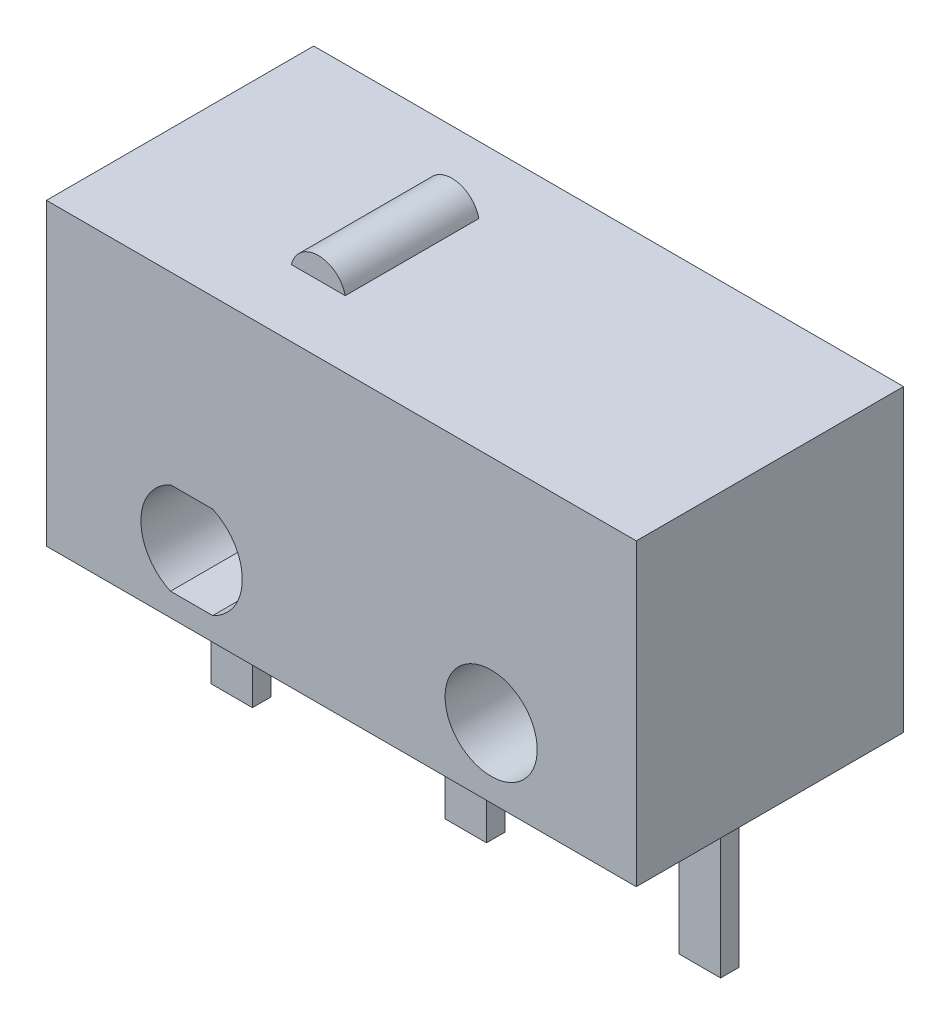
ISO-10303-21;
HEADER;
FILE_DESCRIPTION(('STEP AP214'),'2;1');
FILE_NAME('part.step','',(''),(''),'','','');
FILE_SCHEMA(('AUTOMOTIVE_DESIGN { 1 0 10303 214 1 1 1 1 }'));
ENDSEC;
DATA;
#1=APPLICATION_CONTEXT('core data for automotive mechanical design processes');
#2=APPLICATION_PROTOCOL_DEFINITION('international standard','automotive_design',2000,#1);
#3=PRODUCT_CONTEXT('',#1,'mechanical');
#4=PRODUCT('Part','Part','',(#3));
#5=PRODUCT_RELATED_PRODUCT_CATEGORY('part','',(#4));
#6=PRODUCT_DEFINITION_FORMATION('','',#4);
#7=PRODUCT_DEFINITION_CONTEXT('part definition',#1,'design');
#8=PRODUCT_DEFINITION('design','',#6,#7);
#9=PRODUCT_DEFINITION_SHAPE('','',#8);
#10=(LENGTH_UNIT() NAMED_UNIT(*) SI_UNIT(.MILLI.,.METRE.));
#11=(NAMED_UNIT(*) PLANE_ANGLE_UNIT() SI_UNIT($,.RADIAN.));
#12=(NAMED_UNIT(*) SI_UNIT($,.STERADIAN.) SOLID_ANGLE_UNIT());
#13=UNCERTAINTY_MEASURE_WITH_UNIT(LENGTH_MEASURE(1.E-05),#10,'distance_accuracy_value','');
#14=(GEOMETRIC_REPRESENTATION_CONTEXT(3) GLOBAL_UNCERTAINTY_ASSIGNED_CONTEXT((#13)) GLOBAL_UNIT_ASSIGNED_CONTEXT((#10,
#11,#12)) REPRESENTATION_CONTEXT('',''));
#15=CARTESIAN_POINT('',(0.,0.,0.));
#16=DIRECTION('',(0.,0.,1.));
#17=DIRECTION('',(1.,0.,0.));
#18=AXIS2_PLACEMENT_3D('',#15,#16,#17);
#19=CARTESIAN_POINT('',(-9.65,5.,-2.9));
#20=DIRECTION('',(0.,1.,0.));
#21=DIRECTION('',(0.,0.,1.));
#22=AXIS2_PLACEMENT_3D('',#19,#20,#21);
#23=PLANE('',#22);
#24=DIRECTION('',(0.,0.,1.));
#25=VECTOR('',#24,1.);
#26=CARTESIAN_POINT('',(3.15,5.,-2.9));
#27=LINE('',#26,#25);
#28=CARTESIAN_POINT('',(3.15,5.,-2.9));
#29=VERTEX_POINT('',#28);
#30=CARTESIAN_POINT('',(3.15,5.,2.9));
#31=VERTEX_POINT('',#30);
#32=EDGE_CURVE('E328',#29,#31,#27,.T.);
#33=ORIENTED_EDGE('',*,*,#32,.F.);
#34=DIRECTION('',(1.,0.,0.));
#35=VECTOR('',#34,1.);
#36=CARTESIAN_POINT('',(-9.65,5.,-2.9));
#37=LINE('',#36,#35);
#38=CARTESIAN_POINT('',(-9.65,5.,-2.9));
#39=VERTEX_POINT('',#38);
#40=EDGE_CURVE('E346',#39,#29,#37,.T.);
#41=ORIENTED_EDGE('',*,*,#40,.F.);
#42=DIRECTION('',(0.,0.,1.));
#43=VECTOR('',#42,1.);
#44=CARTESIAN_POINT('',(-9.65,5.,-2.9));
#45=LINE('',#44,#43);
#46=CARTESIAN_POINT('',(-9.65,5.,2.9));
#47=VERTEX_POINT('',#46);
#48=EDGE_CURVE('E340',#39,#47,#45,.T.);
#49=ORIENTED_EDGE('',*,*,#48,.T.);
#50=DIRECTION('',(1.,0.,0.));
#51=VECTOR('',#50,1.);
#52=CARTESIAN_POINT('',(-9.65,5.,2.9));
#53=LINE('',#52,#51);
#54=EDGE_CURVE('E41',#47,#31,#53,.T.);
#55=ORIENTED_EDGE('',*,*,#54,.T.);
#56=EDGE_LOOP('',(#33,#41,#49,#55));
#57=FACE_BOUND('',#56,.T.);
#58=DIRECTION('',(0.,0.,-1.));
#59=VECTOR('',#58,1.);
#60=CARTESIAN_POINT('',(-4.61560692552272,5.,1.45));
#61=LINE('',#60,#59);
#62=CARTESIAN_POINT('',(-4.61560692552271,5.,1.45));
#63=VERTEX_POINT('',#62);
#64=CARTESIAN_POINT('',(-4.61560692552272,5.,-1.45));
#65=VERTEX_POINT('',#64);
#66=EDGE_CURVE('E49',#63,#65,#61,.T.);
#67=ORIENTED_EDGE('',*,*,#66,.F.);
#68=DIRECTION('',(-1.,0.,0.));
#69=VECTOR('',#68,1.);
#70=CARTESIAN_POINT('',(-4.61560692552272,5.,1.45));
#71=LINE('',#70,#69);
#72=CARTESIAN_POINT('',(-5.78439307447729,5.,1.45));
#73=VERTEX_POINT('',#72);
#74=EDGE_CURVE('E54',#63,#73,#71,.T.);
#75=ORIENTED_EDGE('',*,*,#74,.T.);
#76=DIRECTION('',(0.,0.,-1.));
#77=VECTOR('',#76,1.);
#78=CARTESIAN_POINT('',(-5.78439307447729,5.,1.45));
#79=LINE('',#78,#77);
#80=CARTESIAN_POINT('',(-5.78439307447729,5.,-1.45));
#81=VERTEX_POINT('',#80);
#82=EDGE_CURVE('E178',#73,#81,#79,.T.);
#83=ORIENTED_EDGE('',*,*,#82,.T.);
#84=DIRECTION('',(-1.,0.,0.));
#85=VECTOR('',#84,1.);
#86=CARTESIAN_POINT('',(-4.61560692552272,5.,-1.45));
#87=LINE('',#86,#85);
#88=EDGE_CURVE('E181',#65,#81,#87,.T.);
#89=ORIENTED_EDGE('',*,*,#88,.F.);
#90=EDGE_LOOP('',(#67,#75,#83,#89));
#91=FACE_BOUND('',#90,.T.);
#92=ADVANCED_FACE('F32',(#57,#91),#23,.T.);
#93=CARTESIAN_POINT('',(-9.65,-1.5,2.9));
#94=DIRECTION('',(0.,-1.,0.));
#95=DIRECTION('',(0.,0.,-1.));
#96=AXIS2_PLACEMENT_3D('',#93,#94,#95);
#97=PLANE('',#96);
#98=DIRECTION('',(0.,0.,1.));
#99=VECTOR('',#98,1.);
#100=CARTESIAN_POINT('',(-2.8,-1.5,0.2));
#101=LINE('',#100,#99);
#102=CARTESIAN_POINT('',(-2.8,-1.5,-0.2));
#103=VERTEX_POINT('',#102);
#104=CARTESIAN_POINT('',(-2.8,-1.5,0.2));
#105=VERTEX_POINT('',#104);
#106=EDGE_CURVE('E229',#103,#105,#101,.T.);
#107=ORIENTED_EDGE('',*,*,#106,.F.);
#108=DIRECTION('',(1.,0.,0.));
#109=VECTOR('',#108,1.);
#110=CARTESIAN_POINT('',(-2.8,-1.5,-0.2));
#111=LINE('',#110,#109);
#112=CARTESIAN_POINT('',(-3.7,-1.5,-0.2));
#113=VERTEX_POINT('',#112);
#114=EDGE_CURVE('E226',#113,#103,#111,.T.);
#115=ORIENTED_EDGE('',*,*,#114,.F.);
#116=DIRECTION('',(0.,0.,-1.));
#117=VECTOR('',#116,1.);
#118=CARTESIAN_POINT('',(-3.7,-1.5,-0.2));
#119=LINE('',#118,#117);
#120=CARTESIAN_POINT('',(-3.7,-1.5,0.2));
#121=VERTEX_POINT('',#120);
#122=EDGE_CURVE('E234',#121,#113,#119,.T.);
#123=ORIENTED_EDGE('',*,*,#122,.F.);
#124=DIRECTION('',(-1.,0.,0.));
#125=VECTOR('',#124,1.);
#126=CARTESIAN_POINT('',(-3.7,-1.5,0.2));
#127=LINE('',#126,#125);
#128=EDGE_CURVE('E231',#105,#121,#127,.T.);
#129=ORIENTED_EDGE('',*,*,#128,.F.);
#130=EDGE_LOOP('',(#107,#115,#123,#129));
#131=FACE_BOUND('',#130,.T.);
#132=DIRECTION('',(0.,0.,-1.));
#133=VECTOR('',#132,1.);
#134=CARTESIAN_POINT('',(3.15,-1.5,2.9));
#135=LINE('',#134,#133);
#136=CARTESIAN_POINT('',(3.15,-1.5,2.9));
#137=VERTEX_POINT('',#136);
#138=CARTESIAN_POINT('',(3.15,-1.5,-2.9));
#139=VERTEX_POINT('',#138);
#140=EDGE_CURVE('E316',#137,#139,#135,.T.);
#141=ORIENTED_EDGE('',*,*,#140,.F.);
#142=DIRECTION('',(1.,0.,0.));
#143=VECTOR('',#142,1.);
#144=CARTESIAN_POINT('',(-9.65,-1.5,2.9));
#145=LINE('',#144,#143);
#146=CARTESIAN_POINT('',(-9.65,-1.5,2.9));
#147=VERTEX_POINT('',#146);
#148=EDGE_CURVE('E11',#147,#137,#145,.T.);
#149=ORIENTED_EDGE('',*,*,#148,.F.);
#150=DIRECTION('',(0.,0.,-1.));
#151=VECTOR('',#150,1.);
#152=CARTESIAN_POINT('',(-9.65,-1.5,2.9));
#153=LINE('',#152,#151);
#154=CARTESIAN_POINT('',(-9.65,-1.5,-2.9));
#155=VERTEX_POINT('',#154);
#156=EDGE_CURVE('E334',#147,#155,#153,.T.);
#157=ORIENTED_EDGE('',*,*,#156,.T.);
#158=DIRECTION('',(1.,0.,0.));
#159=VECTOR('',#158,1.);
#160=CARTESIAN_POINT('',(-9.65,-1.5,-2.9));
#161=LINE('',#160,#159);
#162=EDGE_CURVE('E36',#155,#139,#161,.T.);
#163=ORIENTED_EDGE('',*,*,#162,.T.);
#164=EDGE_LOOP('',(#141,#149,#157,#163));
#165=FACE_BOUND('',#164,.T.);
#166=DIRECTION('',(0.,0.,-1.));
#167=VECTOR('',#166,1.);
#168=CARTESIAN_POINT('',(-8.78,-1.5,-0.2));
#169=LINE('',#168,#167);
#170=CARTESIAN_POINT('',(-8.78,-1.5,0.2));
#171=VERTEX_POINT('',#170);
#172=CARTESIAN_POINT('',(-8.78,-1.5,-0.2));
#173=VERTEX_POINT('',#172);
#174=EDGE_CURVE('E258',#171,#173,#169,.T.);
#175=ORIENTED_EDGE('',*,*,#174,.F.);
#176=DIRECTION('',(-1.,0.,0.));
#177=VECTOR('',#176,1.);
#178=CARTESIAN_POINT('',(-8.78,-1.5,0.2));
#179=LINE('',#178,#177);
#180=CARTESIAN_POINT('',(-7.88,-1.5,0.2));
#181=VERTEX_POINT('',#180);
#182=EDGE_CURVE('E255',#181,#171,#179,.T.);
#183=ORIENTED_EDGE('',*,*,#182,.F.);
#184=DIRECTION('',(0.,0.,1.));
#185=VECTOR('',#184,1.);
#186=CARTESIAN_POINT('',(-7.88,-1.5,0.2));
#187=LINE('',#186,#185);
#188=CARTESIAN_POINT('',(-7.88,-1.5,-0.2));
#189=VERTEX_POINT('',#188);
#190=EDGE_CURVE('E263',#189,#181,#187,.T.);
#191=ORIENTED_EDGE('',*,*,#190,.F.);
#192=DIRECTION('',(1.,0.,0.));
#193=VECTOR('',#192,1.);
#194=CARTESIAN_POINT('',(-7.88,-1.5,-0.2));
#195=LINE('',#194,#193);
#196=EDGE_CURVE('E260',#173,#189,#195,.T.);
#197=ORIENTED_EDGE('',*,*,#196,.F.);
#198=EDGE_LOOP('',(#175,#183,#191,#197));
#199=FACE_BOUND('',#198,.T.);
#200=DIRECTION('',(0.,0.,1.));
#201=VECTOR('',#200,1.);
#202=CARTESIAN_POINT('',(2.28,-1.5,0.2));
#203=LINE('',#202,#201);
#204=CARTESIAN_POINT('',(2.28,-1.5,-0.2));
#205=VERTEX_POINT('',#204);
#206=CARTESIAN_POINT('',(2.28,-1.5,0.2));
#207=VERTEX_POINT('',#206);
#208=EDGE_CURVE('E200',#205,#207,#203,.T.);
#209=ORIENTED_EDGE('',*,*,#208,.F.);
#210=DIRECTION('',(1.,0.,0.));
#211=VECTOR('',#210,1.);
#212=CARTESIAN_POINT('',(2.28,-1.5,-0.2));
#213=LINE('',#212,#211);
#214=CARTESIAN_POINT('',(1.38,-1.5,-0.2));
#215=VERTEX_POINT('',#214);
#216=EDGE_CURVE('E184',#215,#205,#213,.T.);
#217=ORIENTED_EDGE('',*,*,#216,.F.);
#218=DIRECTION('',(0.,0.,-1.));
#219=VECTOR('',#218,1.);
#220=CARTESIAN_POINT('',(1.38,-1.5,-0.2));
#221=LINE('',#220,#219);
#222=CARTESIAN_POINT('',(1.38,-1.5,0.2));
#223=VERTEX_POINT('',#222);
#224=EDGE_CURVE('E205',#223,#215,#221,.T.);
#225=ORIENTED_EDGE('',*,*,#224,.F.);
#226=DIRECTION('',(-1.,0.,0.));
#227=VECTOR('',#226,1.);
#228=CARTESIAN_POINT('',(1.38,-1.5,0.2));
#229=LINE('',#228,#227);
#230=EDGE_CURVE('E202',#207,#223,#229,.T.);
#231=ORIENTED_EDGE('',*,*,#230,.F.);
#232=EDGE_LOOP('',(#209,#217,#225,#231));
#233=FACE_BOUND('',#232,.T.);
#234=ADVANCED_FACE('F34',(#131,#165,#199,#233),#97,.T.);
#235=CARTESIAN_POINT('',(-9.65,5.,2.9));
#236=DIRECTION('',(0.,0.,1.));
#237=DIRECTION('',(1.,0.,0.));
#238=AXIS2_PLACEMENT_3D('',#235,#236,#237);
#239=PLANE('',#238);
#240=CARTESIAN_POINT('',(0.,0.,2.9));
#241=DIRECTION('',(0.,0.,1.));
#242=DIRECTION('',(-1.,0.,0.));
#243=AXIS2_PLACEMENT_3D('',#240,#241,#242);
#244=CIRCLE('',#243,1.);
#245=CARTESIAN_POINT('',(-1.,0.,2.9));
#246=VERTEX_POINT('',#245);
#247=EDGE_CURVE('E284',#246,#246,#244,.T.);
#248=ORIENTED_EDGE('',*,*,#247,.F.);
#249=EDGE_LOOP('',(#248));
#250=FACE_BOUND('',#249,.T.);
#251=CARTESIAN_POINT('',(-6.5,0.,2.9));
#252=DIRECTION('',(0.,0.,1.));
#253=DIRECTION('',(1.,0.,0.));
#254=AXIS2_PLACEMENT_3D('',#251,#252,#253);
#255=CIRCLE('',#254,1.1);
#256=CARTESIAN_POINT('',(-6.95825756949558,1.,2.9));
#257=VERTEX_POINT('',#256);
#258=CARTESIAN_POINT('',(-6.95825756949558,-1.,2.9));
#259=VERTEX_POINT('',#258);
#260=EDGE_CURVE('E290',#257,#259,#255,.T.);
#261=ORIENTED_EDGE('',*,*,#260,.F.);
#262=DIRECTION('',(-1.,0.,0.));
#263=VECTOR('',#262,1.);
#264=CARTESIAN_POINT('',(-6.04174243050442,1.,2.9));
#265=LINE('',#264,#263);
#266=CARTESIAN_POINT('',(-6.04174243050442,1.,2.9));
#267=VERTEX_POINT('',#266);
#268=EDGE_CURVE('E298',#267,#257,#265,.T.);
#269=ORIENTED_EDGE('',*,*,#268,.F.);
#270=CARTESIAN_POINT('',(-6.5,0.,2.9));
#271=DIRECTION('',(0.,0.,1.));
#272=DIRECTION('',(1.,0.,0.));
#273=AXIS2_PLACEMENT_3D('',#270,#271,#272);
#274=CIRCLE('',#273,1.1);
#275=CARTESIAN_POINT('',(-6.04174243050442,-1.,2.9));
#276=VERTEX_POINT('',#275);
#277=EDGE_CURVE('E295',#276,#267,#274,.T.);
#278=ORIENTED_EDGE('',*,*,#277,.F.);
#279=DIRECTION('',(1.,0.,0.));
#280=VECTOR('',#279,1.);
#281=CARTESIAN_POINT('',(-6.95825756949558,-1.,2.9));
#282=LINE('',#281,#280);
#283=EDGE_CURVE('E292',#259,#276,#282,.T.);
#284=ORIENTED_EDGE('',*,*,#283,.F.);
#285=EDGE_LOOP('',(#261,#269,#278,#284));
#286=FACE_BOUND('',#285,.T.);
#287=DIRECTION('',(0.,-1.,0.));
#288=VECTOR('',#287,1.);
#289=CARTESIAN_POINT('',(3.15,5.,2.9));
#290=LINE('',#289,#288);
#291=EDGE_CURVE('E331',#31,#137,#290,.T.);
#292=ORIENTED_EDGE('',*,*,#291,.F.);
#293=ORIENTED_EDGE('',*,*,#54,.F.);
#294=DIRECTION('',(0.,-1.,0.));
#295=VECTOR('',#294,1.);
#296=CARTESIAN_POINT('',(-9.65,5.,2.9));
#297=LINE('',#296,#295);
#298=EDGE_CURVE('E343',#47,#147,#297,.T.);
#299=ORIENTED_EDGE('',*,*,#298,.T.);
#300=ORIENTED_EDGE('',*,*,#148,.T.);
#301=EDGE_LOOP('',(#292,#293,#299,#300));
#302=FACE_BOUND('',#301,.T.);
#303=ADVANCED_FACE('F360',(#250,#286,#302),#239,.T.);
#304=CARTESIAN_POINT('',(-9.65,-1.5,-2.9));
#305=DIRECTION('',(0.,0.,-1.));
#306=DIRECTION('',(-1.,0.,0.));
#307=AXIS2_PLACEMENT_3D('',#304,#305,#306);
#308=PLANE('',#307);
#309=CARTESIAN_POINT('',(0.,0.,-2.9));
#310=DIRECTION('',(0.,0.,1.));
#311=DIRECTION('',(-1.,0.,0.));
#312=AXIS2_PLACEMENT_3D('',#309,#310,#311);
#313=CIRCLE('',#312,1.);
#314=CARTESIAN_POINT('',(-1.,0.,-2.9));
#315=VERTEX_POINT('',#314);
#316=EDGE_CURVE('E287',#315,#315,#313,.T.);
#317=ORIENTED_EDGE('',*,*,#316,.T.);
#318=EDGE_LOOP('',(#317));
#319=FACE_BOUND('',#318,.T.);
#320=CARTESIAN_POINT('',(-6.5,0.,-2.9));
#321=DIRECTION('',(0.,0.,1.));
#322=DIRECTION('',(1.,0.,0.));
#323=AXIS2_PLACEMENT_3D('',#320,#321,#322);
#324=CIRCLE('',#323,1.1);
#325=CARTESIAN_POINT('',(-6.95825756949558,1.,-2.9));
#326=VERTEX_POINT('',#325);
#327=CARTESIAN_POINT('',(-6.95825756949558,-1.,-2.9));
#328=VERTEX_POINT('',#327);
#329=EDGE_CURVE('E301',#326,#328,#324,.T.);
#330=ORIENTED_EDGE('',*,*,#329,.T.);
#331=DIRECTION('',(1.,0.,0.));
#332=VECTOR('',#331,1.);
#333=CARTESIAN_POINT('',(-6.95825756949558,-1.,-2.9));
#334=LINE('',#333,#332);
#335=CARTESIAN_POINT('',(-6.04174243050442,-1.,-2.9));
#336=VERTEX_POINT('',#335);
#337=EDGE_CURVE('E304',#328,#336,#334,.T.);
#338=ORIENTED_EDGE('',*,*,#337,.T.);
#339=CARTESIAN_POINT('',(-6.5,0.,-2.9));
#340=DIRECTION('',(0.,0.,1.));
#341=DIRECTION('',(1.,0.,0.));
#342=AXIS2_PLACEMENT_3D('',#339,#340,#341);
#343=CIRCLE('',#342,1.1);
#344=CARTESIAN_POINT('',(-6.04174243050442,1.,-2.9));
#345=VERTEX_POINT('',#344);
#346=EDGE_CURVE('E307',#336,#345,#343,.T.);
#347=ORIENTED_EDGE('',*,*,#346,.T.);
#348=DIRECTION('',(-1.,0.,0.));
#349=VECTOR('',#348,1.);
#350=CARTESIAN_POINT('',(-6.04174243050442,1.,-2.9));
#351=LINE('',#350,#349);
#352=EDGE_CURVE('E310',#345,#326,#351,.T.);
#353=ORIENTED_EDGE('',*,*,#352,.T.);
#354=EDGE_LOOP('',(#330,#338,#347,#353));
#355=FACE_BOUND('',#354,.T.);
#356=DIRECTION('',(0.,1.,0.));
#357=VECTOR('',#356,1.);
#358=CARTESIAN_POINT('',(3.15,-1.5,-2.9));
#359=LINE('',#358,#357);
#360=EDGE_CURVE('E325',#139,#29,#359,.T.);
#361=ORIENTED_EDGE('',*,*,#360,.F.);
#362=ORIENTED_EDGE('',*,*,#162,.F.);
#363=DIRECTION('',(0.,1.,0.));
#364=VECTOR('',#363,1.);
#365=CARTESIAN_POINT('',(-9.65,-1.5,-2.9));
#366=LINE('',#365,#364);
#367=EDGE_CURVE('E337',#155,#39,#366,.T.);
#368=ORIENTED_EDGE('',*,*,#367,.T.);
#369=ORIENTED_EDGE('',*,*,#40,.T.);
#370=EDGE_LOOP('',(#361,#362,#368,#369));
#371=FACE_BOUND('',#370,.T.);
#372=ADVANCED_FACE('F355',(#319,#355,#371),#308,.T.);
#373=CARTESIAN_POINT('',(-9.65,-1.5,-2.9));
#374=DIRECTION('',(1.,0.,0.));
#375=DIRECTION('',(0.,0.,-1.));
#376=AXIS2_PLACEMENT_3D('',#373,#374,#375);
#377=PLANE('',#376);
#378=ORIENTED_EDGE('',*,*,#156,.F.);
#379=ORIENTED_EDGE('',*,*,#298,.F.);
#380=ORIENTED_EDGE('',*,*,#48,.F.);
#381=ORIENTED_EDGE('',*,*,#367,.F.);
#382=EDGE_LOOP('',(#378,#379,#380,#381));
#383=FACE_BOUND('',#382,.T.);
#384=ADVANCED_FACE('F363',(#383),#377,.F.);
#385=CARTESIAN_POINT('',(3.15,-1.5,-2.9));
#386=DIRECTION('',(1.,0.,0.));
#387=DIRECTION('',(0.,0.,-1.));
#388=AXIS2_PLACEMENT_3D('',#385,#386,#387);
#389=PLANE('',#388);
#390=ORIENTED_EDGE('',*,*,#140,.T.);
#391=ORIENTED_EDGE('',*,*,#360,.T.);
#392=ORIENTED_EDGE('',*,*,#32,.T.);
#393=ORIENTED_EDGE('',*,*,#291,.T.);
#394=EDGE_LOOP('',(#390,#391,#392,#393));
#395=FACE_BOUND('',#394,.T.);
#396=ADVANCED_FACE('F357',(#395),#389,.T.);
#397=CARTESIAN_POINT('',(-6.5,0.,-2.9));
#398=DIRECTION('',(0.,0.,1.));
#399=DIRECTION('',(1.,0.,0.));
#400=AXIS2_PLACEMENT_3D('',#397,#398,#399);
#401=CYLINDRICAL_SURFACE('',#400,1.1);
#402=ORIENTED_EDGE('',*,*,#260,.T.);
#403=DIRECTION('',(0.,0.,1.));
#404=VECTOR('',#403,1.);
#405=CARTESIAN_POINT('',(-6.95825756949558,-1.,-2.9));
#406=LINE('',#405,#404);
#407=EDGE_CURVE('E313',#328,#259,#406,.T.);
#408=ORIENTED_EDGE('',*,*,#407,.F.);
#409=ORIENTED_EDGE('',*,*,#329,.F.);
#410=DIRECTION('',(0.,0.,1.));
#411=VECTOR('',#410,1.);
#412=CARTESIAN_POINT('',(-6.95825756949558,1.,-2.9));
#413=LINE('',#412,#411);
#414=EDGE_CURVE('E314',#326,#257,#413,.T.);
#415=ORIENTED_EDGE('',*,*,#414,.T.);
#416=EDGE_LOOP('',(#402,#408,#409,#415));
#417=FACE_BOUND('',#416,.T.);
#418=ADVANCED_FACE('F387',(#417),#401,.F.);
#419=CARTESIAN_POINT('',(-6.04174243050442,1.,-2.9));
#420=DIRECTION('',(0.,1.,0.));
#421=DIRECTION('',(0.,0.,1.));
#422=AXIS2_PLACEMENT_3D('',#419,#420,#421);
#423=PLANE('',#422);
#424=ORIENTED_EDGE('',*,*,#268,.T.);
#425=ORIENTED_EDGE('',*,*,#414,.F.);
#426=ORIENTED_EDGE('',*,*,#352,.F.);
#427=DIRECTION('',(0.,0.,1.));
#428=VECTOR('',#427,1.);
#429=CARTESIAN_POINT('',(-6.04174243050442,1.,-2.9));
#430=LINE('',#429,#428);
#431=EDGE_CURVE('E317',#345,#267,#430,.T.);
#432=ORIENTED_EDGE('',*,*,#431,.T.);
#433=EDGE_LOOP('',(#424,#425,#426,#432));
#434=FACE_BOUND('',#433,.T.);
#435=ADVANCED_FACE('F398',(#434),#423,.F.);
#436=CARTESIAN_POINT('',(-6.5,0.,-2.9));
#437=DIRECTION('',(0.,0.,1.));
#438=DIRECTION('',(1.,0.,0.));
#439=AXIS2_PLACEMENT_3D('',#436,#437,#438);
#440=CYLINDRICAL_SURFACE('',#439,1.1);
#441=ORIENTED_EDGE('',*,*,#277,.T.);
#442=ORIENTED_EDGE('',*,*,#431,.F.);
#443=ORIENTED_EDGE('',*,*,#346,.F.);
#444=DIRECTION('',(0.,0.,1.));
#445=VECTOR('',#444,1.);
#446=CARTESIAN_POINT('',(-6.04174243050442,-1.,-2.9));
#447=LINE('',#446,#445);
#448=EDGE_CURVE('E319',#336,#276,#447,.T.);
#449=ORIENTED_EDGE('',*,*,#448,.T.);
#450=EDGE_LOOP('',(#441,#442,#443,#449));
#451=FACE_BOUND('',#450,.T.);
#452=ADVANCED_FACE('F395',(#451),#440,.F.);
#453=CARTESIAN_POINT('',(-6.95825756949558,-1.,-2.9));
#454=DIRECTION('',(0.,-1.,0.));
#455=DIRECTION('',(0.,0.,-1.));
#456=AXIS2_PLACEMENT_3D('',#453,#454,#455);
#457=PLANE('',#456);
#458=ORIENTED_EDGE('',*,*,#283,.T.);
#459=ORIENTED_EDGE('',*,*,#448,.F.);
#460=ORIENTED_EDGE('',*,*,#337,.F.);
#461=ORIENTED_EDGE('',*,*,#407,.T.);
#462=EDGE_LOOP('',(#458,#459,#460,#461));
#463=FACE_BOUND('',#462,.T.);
#464=ADVANCED_FACE('F392',(#463),#457,.F.);
#465=CARTESIAN_POINT('',(0.,0.,-2.9));
#466=DIRECTION('',(0.,0.,1.));
#467=DIRECTION('',(1.,0.,0.));
#468=AXIS2_PLACEMENT_3D('',#465,#466,#467);
#469=CYLINDRICAL_SURFACE('',#468,1.);
#470=ORIENTED_EDGE('',*,*,#316,.F.);
#471=EDGE_LOOP('',(#470));
#472=FACE_BOUND('',#471,.T.);
#473=ORIENTED_EDGE('',*,*,#247,.T.);
#474=EDGE_LOOP('',(#473));
#475=FACE_BOUND('',#474,.T.);
#476=ADVANCED_FACE('F409',(#472,#475),#469,.F.);
#477=CARTESIAN_POINT('',(-8.78,-5.,0.2));
#478=DIRECTION('',(0.,0.,-1.));
#479=DIRECTION('',(-1.,0.,0.));
#480=AXIS2_PLACEMENT_3D('',#477,#478,#479);
#481=PLANE('',#480);
#482=ORIENTED_EDGE('',*,*,#182,.T.);
#483=DIRECTION('',(0.,1.,0.));
#484=VECTOR('',#483,1.);
#485=CARTESIAN_POINT('',(-8.78,-5.,0.2));
#486=LINE('',#485,#484);
#487=CARTESIAN_POINT('',(-8.78,-5.,0.2));
#488=VERTEX_POINT('',#487);
#489=EDGE_CURVE('E282',#488,#171,#486,.T.);
#490=ORIENTED_EDGE('',*,*,#489,.F.);
#491=DIRECTION('',(-1.,0.,0.));
#492=VECTOR('',#491,1.);
#493=CARTESIAN_POINT('',(-8.78,-5.,0.2));
#494=LINE('',#493,#492);
#495=CARTESIAN_POINT('',(-7.88,-5.,0.2));
#496=VERTEX_POINT('',#495);
#497=EDGE_CURVE('E265',#496,#488,#494,.T.);
#498=ORIENTED_EDGE('',*,*,#497,.F.);
#499=DIRECTION('',(0.,1.,0.));
#500=VECTOR('',#499,1.);
#501=CARTESIAN_POINT('',(-7.88,-5.,0.2));
#502=LINE('',#501,#500);
#503=EDGE_CURVE('E274',#496,#181,#502,.T.);
#504=ORIENTED_EDGE('',*,*,#503,.T.);
#505=EDGE_LOOP('',(#482,#490,#498,#504));
#506=FACE_BOUND('',#505,.T.);
#507=ADVANCED_FACE('F459',(#506),#481,.F.);
#508=CARTESIAN_POINT('',(-8.78,-5.,-0.2));
#509=DIRECTION('',(1.,0.,0.));
#510=DIRECTION('',(0.,0.,-1.));
#511=AXIS2_PLACEMENT_3D('',#508,#509,#510);
#512=PLANE('',#511);
#513=ORIENTED_EDGE('',*,*,#174,.T.);
#514=DIRECTION('',(0.,1.,0.));
#515=VECTOR('',#514,1.);
#516=CARTESIAN_POINT('',(-8.78,-5.,-0.2));
#517=LINE('',#516,#515);
#518=CARTESIAN_POINT('',(-8.78,-5.,-0.2));
#519=VERTEX_POINT('',#518);
#520=EDGE_CURVE('E279',#519,#173,#517,.T.);
#521=ORIENTED_EDGE('',*,*,#520,.F.);
#522=DIRECTION('',(0.,0.,-1.));
#523=VECTOR('',#522,1.);
#524=CARTESIAN_POINT('',(-8.78,-5.,-0.2));
#525=LINE('',#524,#523);
#526=EDGE_CURVE('E268',#488,#519,#525,.T.);
#527=ORIENTED_EDGE('',*,*,#526,.F.);
#528=ORIENTED_EDGE('',*,*,#489,.T.);
#529=EDGE_LOOP('',(#513,#521,#527,#528));
#530=FACE_BOUND('',#529,.T.);
#531=ADVANCED_FACE('F468',(#530),#512,.F.);
#532=CARTESIAN_POINT('',(-7.88,-5.,-0.2));
#533=DIRECTION('',(0.,0.,1.));
#534=DIRECTION('',(1.,0.,0.));
#535=AXIS2_PLACEMENT_3D('',#532,#533,#534);
#536=PLANE('',#535);
#537=ORIENTED_EDGE('',*,*,#196,.T.);
#538=DIRECTION('',(0.,1.,0.));
#539=VECTOR('',#538,1.);
#540=CARTESIAN_POINT('',(-7.88,-5.,-0.2));
#541=LINE('',#540,#539);
#542=CARTESIAN_POINT('',(-7.88,-5.,-0.2));
#543=VERTEX_POINT('',#542);
#544=EDGE_CURVE('E277',#543,#189,#541,.T.);
#545=ORIENTED_EDGE('',*,*,#544,.F.);
#546=DIRECTION('',(1.,0.,0.));
#547=VECTOR('',#546,1.);
#548=CARTESIAN_POINT('',(-7.88,-5.,-0.2));
#549=LINE('',#548,#547);
#550=EDGE_CURVE('E270',#519,#543,#549,.T.);
#551=ORIENTED_EDGE('',*,*,#550,.F.);
#552=ORIENTED_EDGE('',*,*,#520,.T.);
#553=EDGE_LOOP('',(#537,#545,#551,#552));
#554=FACE_BOUND('',#553,.T.);
#555=ADVANCED_FACE('F477',(#554),#536,.F.);
#556=CARTESIAN_POINT('',(-7.88,-5.,0.2));
#557=DIRECTION('',(-1.,0.,0.));
#558=DIRECTION('',(0.,0.,1.));
#559=AXIS2_PLACEMENT_3D('',#556,#557,#558);
#560=PLANE('',#559);
#561=ORIENTED_EDGE('',*,*,#190,.T.);
#562=ORIENTED_EDGE('',*,*,#503,.F.);
#563=DIRECTION('',(0.,0.,1.));
#564=VECTOR('',#563,1.);
#565=CARTESIAN_POINT('',(-7.88,-5.,0.2));
#566=LINE('',#565,#564);
#567=EDGE_CURVE('E272',#543,#496,#566,.T.);
#568=ORIENTED_EDGE('',*,*,#567,.F.);
#569=ORIENTED_EDGE('',*,*,#544,.T.);
#570=EDGE_LOOP('',(#561,#562,#568,#569));
#571=FACE_BOUND('',#570,.T.);
#572=ADVANCED_FACE('F487',(#571),#560,.F.);
#573=CARTESIAN_POINT('',(-7.88,-5.,0.2));
#574=DIRECTION('',(0.,1.,0.));
#575=DIRECTION('',(0.,0.,1.));
#576=AXIS2_PLACEMENT_3D('',#573,#574,#575);
#577=PLANE('',#576);
#578=ORIENTED_EDGE('',*,*,#497,.T.);
#579=ORIENTED_EDGE('',*,*,#526,.T.);
#580=ORIENTED_EDGE('',*,*,#550,.T.);
#581=ORIENTED_EDGE('',*,*,#567,.T.);
#582=EDGE_LOOP('',(#578,#579,#580,#581));
#583=FACE_BOUND('',#582,.T.);
#584=ADVANCED_FACE('F497',(#583),#577,.F.);
#585=CARTESIAN_POINT('',(-2.8,-5.,-0.2));
#586=DIRECTION('',(0.,0.,1.));
#587=DIRECTION('',(1.,0.,0.));
#588=AXIS2_PLACEMENT_3D('',#585,#586,#587);
#589=PLANE('',#588);
#590=ORIENTED_EDGE('',*,*,#114,.T.);
#591=DIRECTION('',(0.,1.,0.));
#592=VECTOR('',#591,1.);
#593=CARTESIAN_POINT('',(-2.8,-5.,-0.2));
#594=LINE('',#593,#592);
#595=CARTESIAN_POINT('',(-2.8,-5.,-0.2));
#596=VERTEX_POINT('',#595);
#597=EDGE_CURVE('E253',#596,#103,#594,.T.);
#598=ORIENTED_EDGE('',*,*,#597,.F.);
#599=DIRECTION('',(1.,0.,0.));
#600=VECTOR('',#599,1.);
#601=CARTESIAN_POINT('',(-2.8,-5.,-0.2));
#602=LINE('',#601,#600);
#603=CARTESIAN_POINT('',(-3.7,-5.,-0.2));
#604=VERTEX_POINT('',#603);
#605=EDGE_CURVE('E236',#604,#596,#602,.T.);
#606=ORIENTED_EDGE('',*,*,#605,.F.);
#607=DIRECTION('',(0.,1.,0.));
#608=VECTOR('',#607,1.);
#609=CARTESIAN_POINT('',(-3.7,-5.,-0.2));
#610=LINE('',#609,#608);
#611=EDGE_CURVE('E245',#604,#113,#610,.T.);
#612=ORIENTED_EDGE('',*,*,#611,.T.);
#613=EDGE_LOOP('',(#590,#598,#606,#612));
#614=FACE_BOUND('',#613,.T.);
#615=ADVANCED_FACE('F507',(#614),#589,.F.);
#616=CARTESIAN_POINT('',(-2.8,-5.,0.2));
#617=DIRECTION('',(-1.,0.,0.));
#618=DIRECTION('',(0.,0.,1.));
#619=AXIS2_PLACEMENT_3D('',#616,#617,#618);
#620=PLANE('',#619);
#621=ORIENTED_EDGE('',*,*,#106,.T.);
#622=DIRECTION('',(0.,1.,0.));
#623=VECTOR('',#622,1.);
#624=CARTESIAN_POINT('',(-2.8,-5.,0.2));
#625=LINE('',#624,#623);
#626=CARTESIAN_POINT('',(-2.8,-5.,0.2));
#627=VERTEX_POINT('',#626);
#628=EDGE_CURVE('E250',#627,#105,#625,.T.);
#629=ORIENTED_EDGE('',*,*,#628,.F.);
#630=DIRECTION('',(0.,0.,1.));
#631=VECTOR('',#630,1.);
#632=CARTESIAN_POINT('',(-2.8,-5.,0.2));
#633=LINE('',#632,#631);
#634=EDGE_CURVE('E239',#596,#627,#633,.T.);
#635=ORIENTED_EDGE('',*,*,#634,.F.);
#636=ORIENTED_EDGE('',*,*,#597,.T.);
#637=EDGE_LOOP('',(#621,#629,#635,#636));
#638=FACE_BOUND('',#637,.T.);
#639=ADVANCED_FACE('F517',(#638),#620,.F.);
#640=CARTESIAN_POINT('',(-3.7,-5.,0.2));
#641=DIRECTION('',(0.,0.,-1.));
#642=DIRECTION('',(-1.,0.,0.));
#643=AXIS2_PLACEMENT_3D('',#640,#641,#642);
#644=PLANE('',#643);
#645=ORIENTED_EDGE('',*,*,#128,.T.);
#646=DIRECTION('',(0.,1.,0.));
#647=VECTOR('',#646,1.);
#648=CARTESIAN_POINT('',(-3.7,-5.,0.2));
#649=LINE('',#648,#647);
#650=CARTESIAN_POINT('',(-3.7,-5.,0.2));
#651=VERTEX_POINT('',#650);
#652=EDGE_CURVE('E248',#651,#121,#649,.T.);
#653=ORIENTED_EDGE('',*,*,#652,.F.);
#654=DIRECTION('',(-1.,0.,0.));
#655=VECTOR('',#654,1.);
#656=CARTESIAN_POINT('',(-3.7,-5.,0.2));
#657=LINE('',#656,#655);
#658=EDGE_CURVE('E241',#627,#651,#657,.T.);
#659=ORIENTED_EDGE('',*,*,#658,.F.);
#660=ORIENTED_EDGE('',*,*,#628,.T.);
#661=EDGE_LOOP('',(#645,#653,#659,#660));
#662=FACE_BOUND('',#661,.T.);
#663=ADVANCED_FACE('F527',(#662),#644,.F.);
#664=CARTESIAN_POINT('',(-3.7,-5.,-0.2));
#665=DIRECTION('',(1.,0.,0.));
#666=DIRECTION('',(0.,0.,-1.));
#667=AXIS2_PLACEMENT_3D('',#664,#665,#666);
#668=PLANE('',#667);
#669=ORIENTED_EDGE('',*,*,#122,.T.);
#670=ORIENTED_EDGE('',*,*,#611,.F.);
#671=DIRECTION('',(0.,0.,-1.));
#672=VECTOR('',#671,1.);
#673=CARTESIAN_POINT('',(-3.7,-5.,-0.2));
#674=LINE('',#673,#672);
#675=EDGE_CURVE('E243',#651,#604,#674,.T.);
#676=ORIENTED_EDGE('',*,*,#675,.F.);
#677=ORIENTED_EDGE('',*,*,#652,.T.);
#678=EDGE_LOOP('',(#669,#670,#676,#677));
#679=FACE_BOUND('',#678,.T.);
#680=ADVANCED_FACE('F537',(#679),#668,.F.);
#681=CARTESIAN_POINT('',(-3.7,-5.,-0.2));
#682=DIRECTION('',(0.,1.,0.));
#683=DIRECTION('',(0.,0.,1.));
#684=AXIS2_PLACEMENT_3D('',#681,#682,#683);
#685=PLANE('',#684);
#686=ORIENTED_EDGE('',*,*,#605,.T.);
#687=ORIENTED_EDGE('',*,*,#634,.T.);
#688=ORIENTED_EDGE('',*,*,#658,.T.);
#689=ORIENTED_EDGE('',*,*,#675,.T.);
#690=EDGE_LOOP('',(#686,#687,#688,#689));
#691=FACE_BOUND('',#690,.T.);
#692=ADVANCED_FACE('F547',(#691),#685,.F.);
#693=CARTESIAN_POINT('',(2.28,-5.,-0.2));
#694=DIRECTION('',(0.,0.,1.));
#695=DIRECTION('',(1.,0.,0.));
#696=AXIS2_PLACEMENT_3D('',#693,#694,#695);
#697=PLANE('',#696);
#698=ORIENTED_EDGE('',*,*,#216,.T.);
#699=DIRECTION('',(0.,1.,0.));
#700=VECTOR('',#699,1.);
#701=CARTESIAN_POINT('',(2.28,-5.,-0.2));
#702=LINE('',#701,#700);
#703=CARTESIAN_POINT('',(2.28,-5.,-0.2));
#704=VERTEX_POINT('',#703);
#705=EDGE_CURVE('E224',#704,#205,#702,.T.);
#706=ORIENTED_EDGE('',*,*,#705,.F.);
#707=DIRECTION('',(1.,0.,0.));
#708=VECTOR('',#707,1.);
#709=CARTESIAN_POINT('',(2.28,-5.,-0.2));
#710=LINE('',#709,#708);
#711=CARTESIAN_POINT('',(1.38,-5.,-0.2));
#712=VERTEX_POINT('',#711);
#713=EDGE_CURVE('E207',#712,#704,#710,.T.);
#714=ORIENTED_EDGE('',*,*,#713,.F.);
#715=DIRECTION('',(0.,1.,0.));
#716=VECTOR('',#715,1.);
#717=CARTESIAN_POINT('',(1.38,-5.,-0.2));
#718=LINE('',#717,#716);
#719=EDGE_CURVE('E216',#712,#215,#718,.T.);
#720=ORIENTED_EDGE('',*,*,#719,.T.);
#721=EDGE_LOOP('',(#698,#706,#714,#720));
#722=FACE_BOUND('',#721,.T.);
#723=ADVANCED_FACE('F557',(#722),#697,.F.);
#724=CARTESIAN_POINT('',(2.28,-5.,0.2));
#725=DIRECTION('',(-1.,0.,0.));
#726=DIRECTION('',(0.,0.,1.));
#727=AXIS2_PLACEMENT_3D('',#724,#725,#726);
#728=PLANE('',#727);
#729=ORIENTED_EDGE('',*,*,#208,.T.);
#730=DIRECTION('',(0.,1.,0.));
#731=VECTOR('',#730,1.);
#732=CARTESIAN_POINT('',(2.28,-5.,0.2));
#733=LINE('',#732,#731);
#734=CARTESIAN_POINT('',(2.28,-5.,0.2));
#735=VERTEX_POINT('',#734);
#736=EDGE_CURVE('E221',#735,#207,#733,.T.);
#737=ORIENTED_EDGE('',*,*,#736,.F.);
#738=DIRECTION('',(0.,0.,1.));
#739=VECTOR('',#738,1.);
#740=CARTESIAN_POINT('',(2.28,-5.,0.2));
#741=LINE('',#740,#739);
#742=EDGE_CURVE('E210',#704,#735,#741,.T.);
#743=ORIENTED_EDGE('',*,*,#742,.F.);
#744=ORIENTED_EDGE('',*,*,#705,.T.);
#745=EDGE_LOOP('',(#729,#737,#743,#744));
#746=FACE_BOUND('',#745,.T.);
#747=ADVANCED_FACE('F573',(#746),#728,.F.);
#748=CARTESIAN_POINT('',(1.38,-5.,0.2));
#749=DIRECTION('',(0.,0.,-1.));
#750=DIRECTION('',(-1.,0.,0.));
#751=AXIS2_PLACEMENT_3D('',#748,#749,#750);
#752=PLANE('',#751);
#753=ORIENTED_EDGE('',*,*,#230,.T.);
#754=DIRECTION('',(0.,1.,0.));
#755=VECTOR('',#754,1.);
#756=CARTESIAN_POINT('',(1.38,-5.,0.2));
#757=LINE('',#756,#755);
#758=CARTESIAN_POINT('',(1.38,-5.,0.2));
#759=VERTEX_POINT('',#758);
#760=EDGE_CURVE('E219',#759,#223,#757,.T.);
#761=ORIENTED_EDGE('',*,*,#760,.F.);
#762=DIRECTION('',(-1.,0.,0.));
#763=VECTOR('',#762,1.);
#764=CARTESIAN_POINT('',(1.38,-5.,0.2));
#765=LINE('',#764,#763);
#766=EDGE_CURVE('E212',#735,#759,#765,.T.);
#767=ORIENTED_EDGE('',*,*,#766,.F.);
#768=ORIENTED_EDGE('',*,*,#736,.T.);
#769=EDGE_LOOP('',(#753,#761,#767,#768));
#770=FACE_BOUND('',#769,.T.);
#771=ADVANCED_FACE('F583',(#770),#752,.F.);
#772=CARTESIAN_POINT('',(1.38,-5.,-0.2));
#773=DIRECTION('',(1.,0.,0.));
#774=DIRECTION('',(0.,0.,-1.));
#775=AXIS2_PLACEMENT_3D('',#772,#773,#774);
#776=PLANE('',#775);
#777=ORIENTED_EDGE('',*,*,#224,.T.);
#778=ORIENTED_EDGE('',*,*,#719,.F.);
#779=DIRECTION('',(0.,0.,-1.));
#780=VECTOR('',#779,1.);
#781=CARTESIAN_POINT('',(1.38,-5.,-0.2));
#782=LINE('',#781,#780);
#783=EDGE_CURVE('E214',#759,#712,#782,.T.);
#784=ORIENTED_EDGE('',*,*,#783,.F.);
#785=ORIENTED_EDGE('',*,*,#760,.T.);
#786=EDGE_LOOP('',(#777,#778,#784,#785));
#787=FACE_BOUND('',#786,.T.);
#788=ADVANCED_FACE('F593',(#787),#776,.F.);
#789=CARTESIAN_POINT('',(1.38,-5.,-0.2));
#790=DIRECTION('',(0.,1.,0.));
#791=DIRECTION('',(0.,0.,1.));
#792=AXIS2_PLACEMENT_3D('',#789,#790,#791);
#793=PLANE('',#792);
#794=ORIENTED_EDGE('',*,*,#713,.T.);
#795=ORIENTED_EDGE('',*,*,#742,.T.);
#796=ORIENTED_EDGE('',*,*,#766,.T.);
#797=ORIENTED_EDGE('',*,*,#783,.T.);
#798=EDGE_LOOP('',(#794,#795,#796,#797));
#799=FACE_BOUND('',#798,.T.);
#800=ADVANCED_FACE('F603',(#799),#793,.F.);
#801=CARTESIAN_POINT('',(-5.2,4.86404142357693,1.45));
#802=DIRECTION('',(0.,0.,-1.));
#803=DIRECTION('',(-1.,0.,0.));
#804=AXIS2_PLACEMENT_3D('',#801,#802,#803);
#805=CYLINDRICAL_SURFACE('',#804,0.600000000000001);
#806=CARTESIAN_POINT('',(-5.2,4.86404142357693,-1.45));
#807=DIRECTION('',(0.,0.,-1.));
#808=DIRECTION('',(-1.,0.,0.));
#809=AXIS2_PLACEMENT_3D('',#806,#807,#808);
#810=CIRCLE('',#809,0.600000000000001);
#811=EDGE_CURVE('E187',#81,#65,#810,.T.);
#812=ORIENTED_EDGE('',*,*,#811,.F.);
#813=ORIENTED_EDGE('',*,*,#82,.F.);
#814=CARTESIAN_POINT('',(-5.2,4.86404142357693,1.45));
#815=DIRECTION('',(0.,0.,-1.));
#816=DIRECTION('',(-1.,0.,0.));
#817=AXIS2_PLACEMENT_3D('',#814,#815,#816);
#818=CIRCLE('',#817,0.600000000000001);
#819=EDGE_CURVE('E192',#73,#63,#818,.T.);
#820=ORIENTED_EDGE('',*,*,#819,.T.);
#821=ORIENTED_EDGE('',*,*,#66,.T.);
#822=EDGE_LOOP('',(#812,#813,#820,#821));
#823=FACE_BOUND('',#822,.T.);
#824=ADVANCED_FACE('F188',(#823),#805,.T.);
#825=CARTESIAN_POINT('',(-5.2,4.86404142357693,1.45));
#826=DIRECTION('',(0.,0.,-1.));
#827=DIRECTION('',(-1.,0.,0.));
#828=AXIS2_PLACEMENT_3D('',#825,#826,#827);
#829=PLANE('',#828);
#830=ORIENTED_EDGE('',*,*,#819,.F.);
#831=ORIENTED_EDGE('',*,*,#74,.F.);
#832=EDGE_LOOP('',(#830,#831));
#833=FACE_BOUND('',#832,.T.);
#834=ADVANCED_FACE('F626',(#833),#829,.F.);
#835=CARTESIAN_POINT('',(-5.2,4.86404142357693,-1.45));
#836=DIRECTION('',(0.,0.,-1.));
#837=DIRECTION('',(-1.,0.,0.));
#838=AXIS2_PLACEMENT_3D('',#835,#836,#837);
#839=PLANE('',#838);
#840=ORIENTED_EDGE('',*,*,#811,.T.);
#841=ORIENTED_EDGE('',*,*,#88,.T.);
#842=EDGE_LOOP('',(#840,#841));
#843=FACE_BOUND('',#842,.T.);
#844=ADVANCED_FACE('F191',(#843),#839,.T.);
#845=CLOSED_SHELL('',(#92,#234,#303,#372,#384,#396,#418,#435,#452,#464,#476,#507,#531,#555,#572,
#584,#615,#639,#663,#680,#692,#723,#747,#771,#788,#800,#824,#834,#844));
#846=MANIFOLD_SOLID_BREP('B2',#845);
#847=ADVANCED_BREP_SHAPE_REPRESENTATION('',(#18,#846),#14);
#848=SHAPE_DEFINITION_REPRESENTATION(#9,#847);
ENDSEC;
END-ISO-10303-21;
